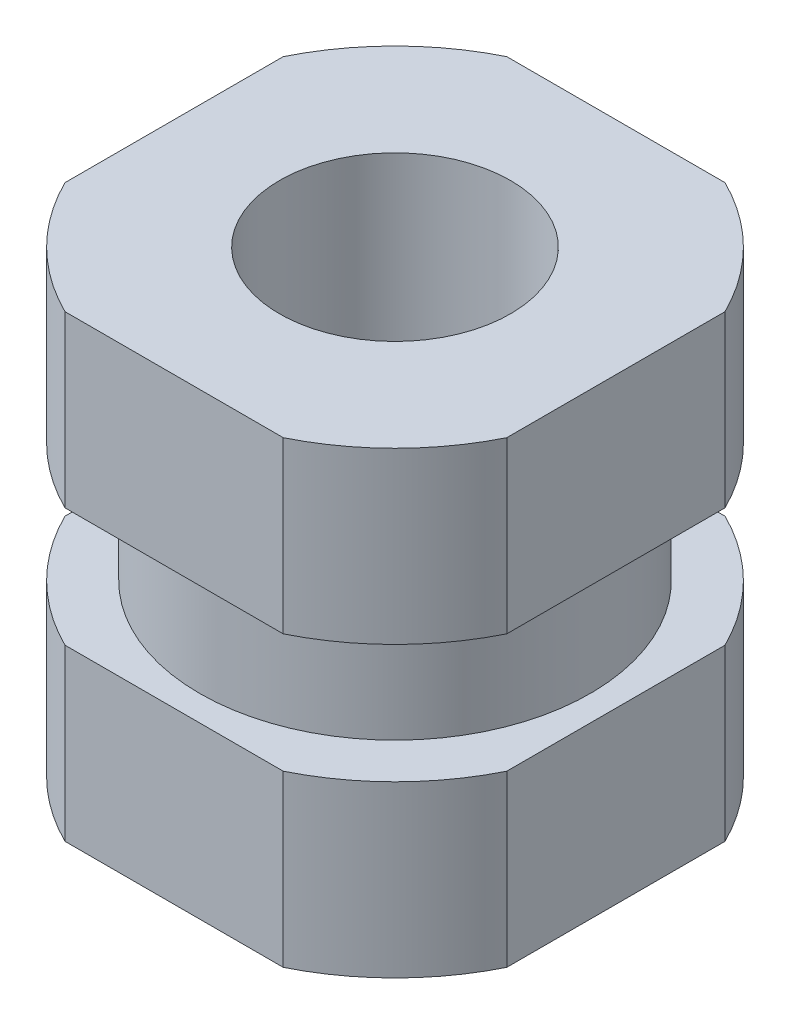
ISO-10303-21;
HEADER;
FILE_DESCRIPTION(('STEP AP214'),'2;1');
FILE_NAME('part.step','',(''),(''),'','','');
FILE_SCHEMA(('AUTOMOTIVE_DESIGN { 1 0 10303 214 1 1 1 1 }'));
ENDSEC;
DATA;
#1=APPLICATION_CONTEXT('core data for automotive mechanical design processes');
#2=APPLICATION_PROTOCOL_DEFINITION('international standard','automotive_design',2000,#1);
#3=PRODUCT_CONTEXT('',#1,'mechanical');
#4=PRODUCT('Part','Part','',(#3));
#5=PRODUCT_RELATED_PRODUCT_CATEGORY('part','',(#4));
#6=PRODUCT_DEFINITION_FORMATION('','',#4);
#7=PRODUCT_DEFINITION_CONTEXT('part definition',#1,'design');
#8=PRODUCT_DEFINITION('design','',#6,#7);
#9=PRODUCT_DEFINITION_SHAPE('','',#8);
#10=(LENGTH_UNIT() NAMED_UNIT(*) SI_UNIT(.MILLI.,.METRE.));
#11=(NAMED_UNIT(*) PLANE_ANGLE_UNIT() SI_UNIT($,.RADIAN.));
#12=(NAMED_UNIT(*) SI_UNIT($,.STERADIAN.) SOLID_ANGLE_UNIT());
#13=UNCERTAINTY_MEASURE_WITH_UNIT(LENGTH_MEASURE(1.E-05),#10,'distance_accuracy_value','');
#14=(GEOMETRIC_REPRESENTATION_CONTEXT(3) GLOBAL_UNCERTAINTY_ASSIGNED_CONTEXT((#13)) GLOBAL_UNIT_ASSIGNED_CONTEXT((#10,
#11,#12)) REPRESENTATION_CONTEXT('',''));
#15=CARTESIAN_POINT('',(0.,0.,0.));
#16=DIRECTION('',(0.,0.,1.));
#17=DIRECTION('',(1.,0.,0.));
#18=AXIS2_PLACEMENT_3D('',#15,#16,#17);
#19=CARTESIAN_POINT('',(-15.0000004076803,-2.00000000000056,0.));
#20=DIRECTION('',(0.,1.,0.));
#21=DIRECTION('',(0.,0.,1.));
#22=AXIS2_PLACEMENT_3D('',#19,#20,#21);
#23=PLANE('',#22);
#24=CARTESIAN_POINT('',(-15.0000004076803,-2.00000000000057,0.));
#25=DIRECTION('',(0.,-1.,0.));
#26=DIRECTION('',(0.,0.,-1.));
#27=AXIS2_PLACEMENT_3D('',#24,#25,#26);
#28=CIRCLE('',#27,3.4);
#29=CARTESIAN_POINT('',(-15.0000004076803,-2.00000000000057,-3.4));
#30=VERTEX_POINT('',#29);
#31=EDGE_CURVE('E285',#30,#30,#28,.T.);
#32=ORIENTED_EDGE('',*,*,#31,.T.);
#33=EDGE_LOOP('',(#32));
#34=FACE_BOUND('',#33,.T.);
#35=CARTESIAN_POINT('',(-15.0000004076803,-2.00000000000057,0.));
#36=DIRECTION('',(0.,1.,0.));
#37=DIRECTION('',(0.,0.,1.));
#38=AXIS2_PLACEMENT_3D('',#35,#36,#37);
#39=CIRCLE('',#38,7.25);
#40=CARTESIAN_POINT('',(-18.2113085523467,-2.00000000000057,-6.5));
#41=VERTEX_POINT('',#40);
#42=CARTESIAN_POINT('',(-21.5000004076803,-2.00000000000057,-3.21130814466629));
#43=VERTEX_POINT('',#42);
#44=EDGE_CURVE('E220',#41,#43,#39,.T.);
#45=ORIENTED_EDGE('',*,*,#44,.T.);
#46=DIRECTION('',(0.,0.,1.));
#47=VECTOR('',#46,1.);
#48=CARTESIAN_POINT('',(-21.5000004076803,-2.00000000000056,0.));
#49=LINE('',#48,#47);
#50=CARTESIAN_POINT('',(-21.5000004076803,-2.00000000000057,3.21130814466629));
#51=VERTEX_POINT('',#50);
#52=EDGE_CURVE('E159',#43,#51,#49,.T.);
#53=ORIENTED_EDGE('',*,*,#52,.T.);
#54=CARTESIAN_POINT('',(-18.2113085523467,-2.00000000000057,6.5));
#55=VERTEX_POINT('',#54);
#56=EDGE_CURVE('E179',#51,#55,#39,.T.);
#57=ORIENTED_EDGE('',*,*,#56,.T.);
#58=DIRECTION('',(1.,0.,0.));
#59=VECTOR('',#58,1.);
#60=CARTESIAN_POINT('',(-15.0000004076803,-2.00000000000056,6.5));
#61=LINE('',#60,#59);
#62=CARTESIAN_POINT('',(-11.7886922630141,-2.00000000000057,6.5));
#63=VERTEX_POINT('',#62);
#64=EDGE_CURVE('E273',#55,#63,#61,.T.);
#65=ORIENTED_EDGE('',*,*,#64,.T.);
#66=CARTESIAN_POINT('',(-8.50000040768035,-2.00000000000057,3.21130814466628));
#67=VERTEX_POINT('',#66);
#68=EDGE_CURVE('E139',#63,#67,#39,.T.);
#69=ORIENTED_EDGE('',*,*,#68,.T.);
#70=DIRECTION('',(0.,0.,-1.));
#71=VECTOR('',#70,1.);
#72=CARTESIAN_POINT('',(-8.50000040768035,-2.00000000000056,0.));
#73=LINE('',#72,#71);
#74=CARTESIAN_POINT('',(-8.50000040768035,-2.00000000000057,-3.21130814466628));
#75=VERTEX_POINT('',#74);
#76=EDGE_CURVE('E226',#67,#75,#73,.T.);
#77=ORIENTED_EDGE('',*,*,#76,.T.);
#78=CARTESIAN_POINT('',(-11.7886922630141,-2.00000000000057,-6.5));
#79=VERTEX_POINT('',#78);
#80=EDGE_CURVE('E182',#75,#79,#39,.T.);
#81=ORIENTED_EDGE('',*,*,#80,.T.);
#82=DIRECTION('',(-1.,0.,0.));
#83=VECTOR('',#82,1.);
#84=CARTESIAN_POINT('',(-15.0000004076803,-2.00000000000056,-6.5));
#85=LINE('',#84,#83);
#86=EDGE_CURVE('E225',#79,#41,#85,.T.);
#87=ORIENTED_EDGE('',*,*,#86,.T.);
#88=EDGE_LOOP('',(#45,#53,#57,#65,#69,#77,#81,#87));
#89=FACE_BOUND('',#88,.T.);
#90=ADVANCED_FACE('F16',(#34,#89),#23,.T.);
#91=CARTESIAN_POINT('',(-15.0000004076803,-2.00000000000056,0.));
#92=DIRECTION('',(0.,1.,0.));
#93=DIRECTION('',(0.,0.,1.));
#94=AXIS2_PLACEMENT_3D('',#91,#92,#93);
#95=CYLINDRICAL_SURFACE('',#94,7.25);
#96=ORIENTED_EDGE('',*,*,#56,.F.);
#97=DIRECTION('',(0.,1.,0.));
#98=VECTOR('',#97,1.);
#99=CARTESIAN_POINT('',(-21.5000004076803,-2.00000000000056,3.21130814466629));
#100=LINE('',#99,#98);
#101=CARTESIAN_POINT('',(-21.5000004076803,-7.00000000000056,3.21130814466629));
#102=VERTEX_POINT('',#101);
#103=EDGE_CURVE('E207',#51,#102,#100,.F.);
#104=ORIENTED_EDGE('',*,*,#103,.T.);
#105=CARTESIAN_POINT('',(-15.0000004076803,-7.00000000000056,0.));
#106=DIRECTION('',(0.,1.,0.));
#107=DIRECTION('',(0.,0.,1.));
#108=AXIS2_PLACEMENT_3D('',#105,#106,#107);
#109=CIRCLE('',#108,7.25);
#110=CARTESIAN_POINT('',(-18.2113085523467,-7.00000000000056,6.5));
#111=VERTEX_POINT('',#110);
#112=EDGE_CURVE('E175',#102,#111,#109,.T.);
#113=ORIENTED_EDGE('',*,*,#112,.T.);
#114=DIRECTION('',(0.,1.,0.));
#115=VECTOR('',#114,1.);
#116=CARTESIAN_POINT('',(-18.2113085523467,-2.00000000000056,6.5));
#117=LINE('',#116,#115);
#118=EDGE_CURVE('E30',#111,#55,#117,.T.);
#119=ORIENTED_EDGE('',*,*,#118,.T.);
#120=EDGE_LOOP('',(#96,#104,#113,#119));
#121=FACE_BOUND('',#120,.T.);
#122=ADVANCED_FACE('F221',(#121),#95,.T.);
#123=CARTESIAN_POINT('',(-18.2113085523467,-7.00000000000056,-6.5));
#124=VERTEX_POINT('',#123);
#125=CARTESIAN_POINT('',(-21.5000004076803,-7.00000000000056,-3.21130814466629));
#126=VERTEX_POINT('',#125);
#127=EDGE_CURVE('E357',#124,#126,#109,.T.);
#128=ORIENTED_EDGE('',*,*,#127,.T.);
#129=DIRECTION('',(0.,1.,0.));
#130=VECTOR('',#129,1.);
#131=CARTESIAN_POINT('',(-21.5000004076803,-2.00000000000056,-3.21130814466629));
#132=LINE('',#131,#130);
#133=EDGE_CURVE('E38',#126,#43,#132,.T.);
#134=ORIENTED_EDGE('',*,*,#133,.T.);
#135=ORIENTED_EDGE('',*,*,#44,.F.);
#136=DIRECTION('',(0.,1.,0.));
#137=VECTOR('',#136,1.);
#138=CARTESIAN_POINT('',(-18.2113085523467,-2.00000000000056,-6.5));
#139=LINE('',#138,#137);
#140=EDGE_CURVE('E237',#41,#124,#139,.F.);
#141=ORIENTED_EDGE('',*,*,#140,.T.);
#142=EDGE_LOOP('',(#128,#134,#135,#141));
#143=FACE_BOUND('',#142,.T.);
#144=ADVANCED_FACE('F316',(#143),#95,.T.);
#145=ORIENTED_EDGE('',*,*,#68,.F.);
#146=DIRECTION('',(0.,1.,0.));
#147=VECTOR('',#146,1.);
#148=CARTESIAN_POINT('',(-11.7886922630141,-2.00000000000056,6.5));
#149=LINE('',#148,#147);
#150=CARTESIAN_POINT('',(-11.7886922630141,-7.00000000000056,6.5));
#151=VERTEX_POINT('',#150);
#152=EDGE_CURVE('E270',#63,#151,#149,.F.);
#153=ORIENTED_EDGE('',*,*,#152,.T.);
#154=CARTESIAN_POINT('',(-8.50000040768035,-7.00000000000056,3.21130814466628));
#155=VERTEX_POINT('',#154);
#156=EDGE_CURVE('E176',#151,#155,#109,.T.);
#157=ORIENTED_EDGE('',*,*,#156,.T.);
#158=DIRECTION('',(0.,1.,0.));
#159=VECTOR('',#158,1.);
#160=CARTESIAN_POINT('',(-8.50000040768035,-2.00000000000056,3.21130814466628));
#161=LINE('',#160,#159);
#162=EDGE_CURVE('E256',#155,#67,#161,.T.);
#163=ORIENTED_EDGE('',*,*,#162,.T.);
#164=EDGE_LOOP('',(#145,#153,#157,#163));
#165=FACE_BOUND('',#164,.T.);
#166=ADVANCED_FACE('F356',(#165),#95,.T.);
#167=ORIENTED_EDGE('',*,*,#80,.F.);
#168=DIRECTION('',(0.,1.,0.));
#169=VECTOR('',#168,1.);
#170=CARTESIAN_POINT('',(-8.50000040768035,-2.00000000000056,-3.21130814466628));
#171=LINE('',#170,#169);
#172=CARTESIAN_POINT('',(-8.50000040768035,-7.00000000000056,-3.21130814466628));
#173=VERTEX_POINT('',#172);
#174=EDGE_CURVE('E232',#75,#173,#171,.F.);
#175=ORIENTED_EDGE('',*,*,#174,.T.);
#176=CARTESIAN_POINT('',(-11.7886922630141,-7.00000000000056,-6.5));
#177=VERTEX_POINT('',#176);
#178=EDGE_CURVE('E180',#173,#177,#109,.T.);
#179=ORIENTED_EDGE('',*,*,#178,.T.);
#180=DIRECTION('',(0.,1.,0.));
#181=VECTOR('',#180,1.);
#182=CARTESIAN_POINT('',(-11.7886922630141,-2.00000000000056,-6.5));
#183=LINE('',#182,#181);
#184=EDGE_CURVE('E234',#177,#79,#183,.T.);
#185=ORIENTED_EDGE('',*,*,#184,.T.);
#186=EDGE_LOOP('',(#167,#175,#179,#185));
#187=FACE_BOUND('',#186,.T.);
#188=ADVANCED_FACE('F230',(#187),#95,.T.);
#189=CARTESIAN_POINT('',(-22.2500004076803,-7.00000000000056,0.));
#190=DIRECTION('',(0.,-1.,0.));
#191=DIRECTION('',(0.,0.,-1.));
#192=AXIS2_PLACEMENT_3D('',#189,#190,#191);
#193=PLANE('',#192);
#194=CARTESIAN_POINT('',(-15.0000004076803,-7.00000000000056,0.));
#195=DIRECTION('',(0.,1.,0.));
#196=DIRECTION('',(0.,0.,1.));
#197=AXIS2_PLACEMENT_3D('',#194,#195,#196);
#198=CIRCLE('',#197,5.75);
#199=CARTESIAN_POINT('',(-15.0000004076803,-7.00000000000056,5.75));
#200=VERTEX_POINT('',#199);
#201=EDGE_CURVE('E172',#200,#200,#198,.T.);
#202=ORIENTED_EDGE('',*,*,#201,.T.);
#203=EDGE_LOOP('',(#202));
#204=FACE_BOUND('',#203,.T.);
#205=ORIENTED_EDGE('',*,*,#112,.F.);
#206=DIRECTION('',(0.,0.,-1.));
#207=VECTOR('',#206,1.);
#208=CARTESIAN_POINT('',(-21.5000004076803,-7.00000000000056,0.));
#209=LINE('',#208,#207);
#210=EDGE_CURVE('E199',#102,#126,#209,.T.);
#211=ORIENTED_EDGE('',*,*,#210,.T.);
#212=ORIENTED_EDGE('',*,*,#127,.F.);
#213=DIRECTION('',(1.,0.,0.));
#214=VECTOR('',#213,1.);
#215=CARTESIAN_POINT('',(-22.2500004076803,-7.00000000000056,-6.5));
#216=LINE('',#215,#214);
#217=EDGE_CURVE('E149',#124,#177,#216,.T.);
#218=ORIENTED_EDGE('',*,*,#217,.T.);
#219=ORIENTED_EDGE('',*,*,#178,.F.);
#220=DIRECTION('',(0.,0.,1.));
#221=VECTOR('',#220,1.);
#222=CARTESIAN_POINT('',(-8.50000040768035,-7.00000000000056,0.));
#223=LINE('',#222,#221);
#224=EDGE_CURVE('E253',#173,#155,#223,.T.);
#225=ORIENTED_EDGE('',*,*,#224,.T.);
#226=ORIENTED_EDGE('',*,*,#156,.F.);
#227=DIRECTION('',(-1.,0.,0.));
#228=VECTOR('',#227,1.);
#229=CARTESIAN_POINT('',(-22.2500004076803,-7.00000000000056,6.5));
#230=LINE('',#229,#228);
#231=EDGE_CURVE('E267',#151,#111,#230,.T.);
#232=ORIENTED_EDGE('',*,*,#231,.T.);
#233=EDGE_LOOP('',(#205,#211,#212,#218,#219,#225,#226,#232));
#234=FACE_BOUND('',#233,.T.);
#235=ADVANCED_FACE('F355',(#204,#234),#193,.T.);
#236=CARTESIAN_POINT('',(-22.2500004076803,-10.5000000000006,0.));
#237=DIRECTION('',(0.,1.,0.));
#238=DIRECTION('',(0.,0.,1.));
#239=AXIS2_PLACEMENT_3D('',#236,#237,#238);
#240=PLANE('',#239);
#241=CARTESIAN_POINT('',(-15.0000004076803,-10.5000000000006,0.));
#242=DIRECTION('',(0.,1.,0.));
#243=DIRECTION('',(0.,0.,1.));
#244=AXIS2_PLACEMENT_3D('',#241,#242,#243);
#245=CIRCLE('',#244,5.75);
#246=CARTESIAN_POINT('',(-15.0000004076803,-10.5000000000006,5.75));
#247=VERTEX_POINT('',#246);
#248=EDGE_CURVE('E168',#247,#247,#245,.T.);
#249=ORIENTED_EDGE('',*,*,#248,.F.);
#250=EDGE_LOOP('',(#249));
#251=FACE_BOUND('',#250,.T.);
#252=CARTESIAN_POINT('',(-15.0000004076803,-10.5000000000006,0.));
#253=DIRECTION('',(0.,1.,0.));
#254=DIRECTION('',(0.,0.,1.));
#255=AXIS2_PLACEMENT_3D('',#252,#253,#254);
#256=CIRCLE('',#255,7.25);
#257=CARTESIAN_POINT('',(-18.2113085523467,-10.5000000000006,-6.5));
#258=VERTEX_POINT('',#257);
#259=CARTESIAN_POINT('',(-21.5000004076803,-10.5000000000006,-3.21130814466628));
#260=VERTEX_POINT('',#259);
#261=EDGE_CURVE('E148',#258,#260,#256,.T.);
#262=ORIENTED_EDGE('',*,*,#261,.T.);
#263=DIRECTION('',(0.,0.,1.));
#264=VECTOR('',#263,1.);
#265=CARTESIAN_POINT('',(-21.5000004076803,-10.5000000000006,0.));
#266=LINE('',#265,#264);
#267=CARTESIAN_POINT('',(-21.5000004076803,-10.5000000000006,3.21130814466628));
#268=VERTEX_POINT('',#267);
#269=EDGE_CURVE('E200',#260,#268,#266,.T.);
#270=ORIENTED_EDGE('',*,*,#269,.T.);
#271=CARTESIAN_POINT('',(-18.2113085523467,-10.5000000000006,6.5));
#272=VERTEX_POINT('',#271);
#273=EDGE_CURVE('E163',#268,#272,#256,.T.);
#274=ORIENTED_EDGE('',*,*,#273,.T.);
#275=DIRECTION('',(1.,0.,0.));
#276=VECTOR('',#275,1.);
#277=CARTESIAN_POINT('',(-22.2500004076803,-10.5000000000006,6.5));
#278=LINE('',#277,#276);
#279=CARTESIAN_POINT('',(-11.7886922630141,-10.5000000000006,6.5));
#280=VERTEX_POINT('',#279);
#281=EDGE_CURVE('E262',#272,#280,#278,.T.);
#282=ORIENTED_EDGE('',*,*,#281,.T.);
#283=CARTESIAN_POINT('',(-8.50000040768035,-10.5000000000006,3.21130814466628));
#284=VERTEX_POINT('',#283);
#285=EDGE_CURVE('E165',#280,#284,#256,.T.);
#286=ORIENTED_EDGE('',*,*,#285,.T.);
#287=DIRECTION('',(0.,0.,-1.));
#288=VECTOR('',#287,1.);
#289=CARTESIAN_POINT('',(-8.50000040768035,-10.5000000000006,0.));
#290=LINE('',#289,#288);
#291=CARTESIAN_POINT('',(-8.50000040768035,-10.5000000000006,-3.21130814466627));
#292=VERTEX_POINT('',#291);
#293=EDGE_CURVE('E247',#284,#292,#290,.T.);
#294=ORIENTED_EDGE('',*,*,#293,.T.);
#295=CARTESIAN_POINT('',(-11.7886922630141,-10.5000000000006,-6.5));
#296=VERTEX_POINT('',#295);
#297=EDGE_CURVE('E169',#292,#296,#256,.T.);
#298=ORIENTED_EDGE('',*,*,#297,.T.);
#299=DIRECTION('',(-1.,0.,0.));
#300=VECTOR('',#299,1.);
#301=CARTESIAN_POINT('',(-22.2500004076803,-10.5000000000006,-6.5));
#302=LINE('',#301,#300);
#303=EDGE_CURVE('E150',#296,#258,#302,.T.);
#304=ORIENTED_EDGE('',*,*,#303,.T.);
#305=EDGE_LOOP('',(#262,#270,#274,#282,#286,#294,#298,#304));
#306=FACE_BOUND('',#305,.T.);
#307=ADVANCED_FACE('F275',(#251,#306),#240,.T.);
#308=CARTESIAN_POINT('',(-15.0000004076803,-2.00000000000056,0.));
#309=DIRECTION('',(0.,1.,0.));
#310=DIRECTION('',(0.,0.,1.));
#311=AXIS2_PLACEMENT_3D('',#308,#309,#310);
#312=CYLINDRICAL_SURFACE('',#311,7.25);
#313=ORIENTED_EDGE('',*,*,#273,.F.);
#314=DIRECTION('',(0.,1.,0.));
#315=VECTOR('',#314,1.);
#316=CARTESIAN_POINT('',(-21.5000004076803,-2.00000000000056,3.21130814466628));
#317=LINE('',#316,#315);
#318=CARTESIAN_POINT('',(-21.5000004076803,-15.5000000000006,3.21130814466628));
#319=VERTEX_POINT('',#318);
#320=EDGE_CURVE('E196',#268,#319,#317,.F.);
#321=ORIENTED_EDGE('',*,*,#320,.T.);
#322=CARTESIAN_POINT('',(-15.0000004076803,-15.5000000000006,0.));
#323=DIRECTION('',(0.,1.,0.));
#324=DIRECTION('',(0.,0.,1.));
#325=AXIS2_PLACEMENT_3D('',#322,#323,#324);
#326=CIRCLE('',#325,7.25);
#327=CARTESIAN_POINT('',(-18.2113085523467,-15.5000000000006,6.5));
#328=VERTEX_POINT('',#327);
#329=EDGE_CURVE('E155',#319,#328,#326,.T.);
#330=ORIENTED_EDGE('',*,*,#329,.T.);
#331=DIRECTION('',(0.,1.,0.));
#332=VECTOR('',#331,1.);
#333=CARTESIAN_POINT('',(-18.2113085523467,-2.00000000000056,6.5));
#334=LINE('',#333,#332);
#335=EDGE_CURVE('E194',#328,#272,#334,.T.);
#336=ORIENTED_EDGE('',*,*,#335,.T.);
#337=EDGE_LOOP('',(#313,#321,#330,#336));
#338=FACE_BOUND('',#337,.T.);
#339=ADVANCED_FACE('F193',(#338),#312,.T.);
#340=CARTESIAN_POINT('',(-18.2113085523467,-15.5000000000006,-6.5));
#341=VERTEX_POINT('',#340);
#342=CARTESIAN_POINT('',(-21.5000004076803,-15.5000000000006,-3.21130814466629));
#343=VERTEX_POINT('',#342);
#344=EDGE_CURVE('E146',#341,#343,#326,.T.);
#345=ORIENTED_EDGE('',*,*,#344,.T.);
#346=DIRECTION('',(0.,1.,0.));
#347=VECTOR('',#346,1.);
#348=CARTESIAN_POINT('',(-21.5000004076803,-2.00000000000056,-3.21130814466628));
#349=LINE('',#348,#347);
#350=EDGE_CURVE('E203',#343,#260,#349,.T.);
#351=ORIENTED_EDGE('',*,*,#350,.T.);
#352=ORIENTED_EDGE('',*,*,#261,.F.);
#353=DIRECTION('',(0.,1.,0.));
#354=VECTOR('',#353,1.);
#355=CARTESIAN_POINT('',(-18.2113085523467,-2.00000000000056,-6.5));
#356=LINE('',#355,#354);
#357=EDGE_CURVE('E130',#258,#341,#356,.F.);
#358=ORIENTED_EDGE('',*,*,#357,.T.);
#359=EDGE_LOOP('',(#345,#351,#352,#358));
#360=FACE_BOUND('',#359,.T.);
#361=ADVANCED_FACE('F144',(#360),#312,.T.);
#362=ORIENTED_EDGE('',*,*,#285,.F.);
#363=DIRECTION('',(0.,1.,0.));
#364=VECTOR('',#363,1.);
#365=CARTESIAN_POINT('',(-11.7886922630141,-2.00000000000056,6.5));
#366=LINE('',#365,#364);
#367=CARTESIAN_POINT('',(-11.7886922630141,-15.5000000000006,6.5));
#368=VERTEX_POINT('',#367);
#369=EDGE_CURVE('E265',#280,#368,#366,.F.);
#370=ORIENTED_EDGE('',*,*,#369,.T.);
#371=CARTESIAN_POINT('',(-8.50000040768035,-15.5000000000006,3.21130814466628));
#372=VERTEX_POINT('',#371);
#373=EDGE_CURVE('E157',#368,#372,#326,.T.);
#374=ORIENTED_EDGE('',*,*,#373,.T.);
#375=DIRECTION('',(0.,1.,0.));
#376=VECTOR('',#375,1.);
#377=CARTESIAN_POINT('',(-8.50000040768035,-2.00000000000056,3.21130814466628));
#378=LINE('',#377,#376);
#379=EDGE_CURVE('E244',#372,#284,#378,.T.);
#380=ORIENTED_EDGE('',*,*,#379,.T.);
#381=EDGE_LOOP('',(#362,#370,#374,#380));
#382=FACE_BOUND('',#381,.T.);
#383=ADVANCED_FACE('F279',(#382),#312,.T.);
#384=ORIENTED_EDGE('',*,*,#297,.F.);
#385=DIRECTION('',(0.,1.,0.));
#386=VECTOR('',#385,1.);
#387=CARTESIAN_POINT('',(-8.50000040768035,-2.00000000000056,-3.21130814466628));
#388=LINE('',#387,#386);
#389=CARTESIAN_POINT('',(-8.50000040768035,-15.5000000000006,-3.21130814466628));
#390=VERTEX_POINT('',#389);
#391=EDGE_CURVE('E250',#292,#390,#388,.F.);
#392=ORIENTED_EDGE('',*,*,#391,.T.);
#393=CARTESIAN_POINT('',(-11.7886922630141,-15.5000000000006,-6.5));
#394=VERTEX_POINT('',#393);
#395=EDGE_CURVE('E154',#390,#394,#326,.T.);
#396=ORIENTED_EDGE('',*,*,#395,.T.);
#397=DIRECTION('',(0.,1.,0.));
#398=VECTOR('',#397,1.);
#399=CARTESIAN_POINT('',(-11.7886922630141,-2.00000000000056,-6.5));
#400=LINE('',#399,#398);
#401=EDGE_CURVE('E133',#394,#296,#400,.T.);
#402=ORIENTED_EDGE('',*,*,#401,.T.);
#403=EDGE_LOOP('',(#384,#392,#396,#402));
#404=FACE_BOUND('',#403,.T.);
#405=ADVANCED_FACE('F284',(#404),#312,.T.);
#406=CARTESIAN_POINT('',(-22.2500004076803,-15.5000000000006,0.));
#407=DIRECTION('',(0.,-1.,0.));
#408=DIRECTION('',(0.,0.,-1.));
#409=AXIS2_PLACEMENT_3D('',#406,#407,#408);
#410=PLANE('',#409);
#411=CARTESIAN_POINT('',(-15.0000004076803,-15.5000000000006,0.));
#412=DIRECTION('',(0.,-1.,0.));
#413=DIRECTION('',(0.,0.,-1.));
#414=AXIS2_PLACEMENT_3D('',#411,#412,#413);
#415=CIRCLE('',#414,3.4);
#416=CARTESIAN_POINT('',(-15.0000004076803,-15.5000000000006,-3.4));
#417=VERTEX_POINT('',#416);
#418=EDGE_CURVE('E289',#417,#417,#415,.T.);
#419=ORIENTED_EDGE('',*,*,#418,.F.);
#420=EDGE_LOOP('',(#419));
#421=FACE_BOUND('',#420,.T.);
#422=ORIENTED_EDGE('',*,*,#329,.F.);
#423=DIRECTION('',(0.,0.,-1.));
#424=VECTOR('',#423,1.);
#425=CARTESIAN_POINT('',(-21.5000004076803,-15.5000000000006,0.));
#426=LINE('',#425,#424);
#427=EDGE_CURVE('E11',#319,#343,#426,.T.);
#428=ORIENTED_EDGE('',*,*,#427,.T.);
#429=ORIENTED_EDGE('',*,*,#344,.F.);
#430=DIRECTION('',(1.,0.,0.));
#431=VECTOR('',#430,1.);
#432=CARTESIAN_POINT('',(-22.2500004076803,-15.5000000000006,-6.5));
#433=LINE('',#432,#431);
#434=EDGE_CURVE('E127',#341,#394,#433,.T.);
#435=ORIENTED_EDGE('',*,*,#434,.T.);
#436=ORIENTED_EDGE('',*,*,#395,.F.);
#437=DIRECTION('',(0.,0.,1.));
#438=VECTOR('',#437,1.);
#439=CARTESIAN_POINT('',(-8.50000040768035,-15.5000000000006,0.));
#440=LINE('',#439,#438);
#441=EDGE_CURVE('E138',#390,#372,#440,.T.);
#442=ORIENTED_EDGE('',*,*,#441,.T.);
#443=ORIENTED_EDGE('',*,*,#373,.F.);
#444=DIRECTION('',(-1.,0.,0.));
#445=VECTOR('',#444,1.);
#446=CARTESIAN_POINT('',(-22.2500004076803,-15.5000000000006,6.5));
#447=LINE('',#446,#445);
#448=EDGE_CURVE('E23',#368,#328,#447,.T.);
#449=ORIENTED_EDGE('',*,*,#448,.T.);
#450=EDGE_LOOP('',(#422,#428,#429,#435,#436,#442,#443,#449));
#451=FACE_BOUND('',#450,.T.);
#452=ADVANCED_FACE('F153',(#421,#451),#410,.T.);
#453=CARTESIAN_POINT('',(-15.0000004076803,-2.00000000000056,0.));
#454=DIRECTION('',(0.,1.,0.));
#455=DIRECTION('',(0.,0.,1.));
#456=AXIS2_PLACEMENT_3D('',#453,#454,#455);
#457=CYLINDRICAL_SURFACE('',#456,5.75);
#458=ORIENTED_EDGE('',*,*,#248,.T.);
#459=EDGE_LOOP('',(#458));
#460=FACE_BOUND('',#459,.T.);
#461=ORIENTED_EDGE('',*,*,#201,.F.);
#462=EDGE_LOOP('',(#461));
#463=FACE_BOUND('',#462,.T.);
#464=ADVANCED_FACE('F298',(#460,#463),#457,.T.);
#465=CARTESIAN_POINT('',(-8.50000040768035,-0.500000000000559,-6.5));
#466=DIRECTION('',(0.,0.,-1.));
#467=DIRECTION('',(-1.,0.,0.));
#468=AXIS2_PLACEMENT_3D('',#465,#466,#467);
#469=PLANE('',#468);
#470=ORIENTED_EDGE('',*,*,#303,.F.);
#471=ORIENTED_EDGE('',*,*,#401,.F.);
#472=ORIENTED_EDGE('',*,*,#434,.F.);
#473=ORIENTED_EDGE('',*,*,#357,.F.);
#474=EDGE_LOOP('',(#470,#471,#472,#473));
#475=FACE_BOUND('',#474,.T.);
#476=ADVANCED_FACE('F129',(#475),#469,.T.);
#477=CARTESIAN_POINT('',(-8.50000040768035,-0.500000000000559,-6.5));
#478=DIRECTION('',(1.,0.,0.));
#479=DIRECTION('',(0.,0.,-1.));
#480=AXIS2_PLACEMENT_3D('',#477,#478,#479);
#481=PLANE('',#480);
#482=ORIENTED_EDGE('',*,*,#293,.F.);
#483=ORIENTED_EDGE('',*,*,#379,.F.);
#484=ORIENTED_EDGE('',*,*,#441,.F.);
#485=ORIENTED_EDGE('',*,*,#391,.F.);
#486=EDGE_LOOP('',(#482,#483,#484,#485));
#487=FACE_BOUND('',#486,.T.);
#488=ADVANCED_FACE('F281',(#487),#481,.T.);
#489=CARTESIAN_POINT('',(-8.50000040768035,-0.500000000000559,6.5));
#490=DIRECTION('',(0.,0.,1.));
#491=DIRECTION('',(1.,0.,0.));
#492=AXIS2_PLACEMENT_3D('',#489,#490,#491);
#493=PLANE('',#492);
#494=ORIENTED_EDGE('',*,*,#281,.F.);
#495=ORIENTED_EDGE('',*,*,#335,.F.);
#496=ORIENTED_EDGE('',*,*,#448,.F.);
#497=ORIENTED_EDGE('',*,*,#369,.F.);
#498=EDGE_LOOP('',(#494,#495,#496,#497));
#499=FACE_BOUND('',#498,.T.);
#500=ADVANCED_FACE('F329',(#499),#493,.T.);
#501=CARTESIAN_POINT('',(-21.5000004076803,-0.500000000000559,-6.5));
#502=DIRECTION('',(-1.,0.,0.));
#503=DIRECTION('',(0.,0.,1.));
#504=AXIS2_PLACEMENT_3D('',#501,#502,#503);
#505=PLANE('',#504);
#506=ORIENTED_EDGE('',*,*,#269,.F.);
#507=ORIENTED_EDGE('',*,*,#350,.F.);
#508=ORIENTED_EDGE('',*,*,#427,.F.);
#509=ORIENTED_EDGE('',*,*,#320,.F.);
#510=EDGE_LOOP('',(#506,#507,#508,#509));
#511=FACE_BOUND('',#510,.T.);
#512=ADVANCED_FACE('F327',(#511),#505,.T.);
#513=ORIENTED_EDGE('',*,*,#184,.F.);
#514=ORIENTED_EDGE('',*,*,#217,.F.);
#515=ORIENTED_EDGE('',*,*,#140,.F.);
#516=ORIENTED_EDGE('',*,*,#86,.F.);
#517=EDGE_LOOP('',(#513,#514,#515,#516));
#518=FACE_BOUND('',#517,.T.);
#519=ADVANCED_FACE('F336',(#518),#469,.T.);
#520=ORIENTED_EDGE('',*,*,#162,.F.);
#521=ORIENTED_EDGE('',*,*,#224,.F.);
#522=ORIENTED_EDGE('',*,*,#174,.F.);
#523=ORIENTED_EDGE('',*,*,#76,.F.);
#524=EDGE_LOOP('',(#520,#521,#522,#523));
#525=FACE_BOUND('',#524,.T.);
#526=ADVANCED_FACE('F334',(#525),#481,.T.);
#527=ORIENTED_EDGE('',*,*,#118,.F.);
#528=ORIENTED_EDGE('',*,*,#231,.F.);
#529=ORIENTED_EDGE('',*,*,#152,.F.);
#530=ORIENTED_EDGE('',*,*,#64,.F.);
#531=EDGE_LOOP('',(#527,#528,#529,#530));
#532=FACE_BOUND('',#531,.T.);
#533=ADVANCED_FACE('F326',(#532),#493,.T.);
#534=ORIENTED_EDGE('',*,*,#133,.F.);
#535=ORIENTED_EDGE('',*,*,#210,.F.);
#536=ORIENTED_EDGE('',*,*,#103,.F.);
#537=ORIENTED_EDGE('',*,*,#52,.F.);
#538=EDGE_LOOP('',(#534,#535,#536,#537));
#539=FACE_BOUND('',#538,.T.);
#540=ADVANCED_FACE('F320',(#539),#505,.T.);
#541=CARTESIAN_POINT('',(-15.0000004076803,-15.5000000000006,0.));
#542=DIRECTION('',(0.,-1.,0.));
#543=DIRECTION('',(0.,0.,-1.));
#544=AXIS2_PLACEMENT_3D('',#541,#542,#543);
#545=CYLINDRICAL_SURFACE('',#544,3.4);
#546=ORIENTED_EDGE('',*,*,#31,.F.);
#547=EDGE_LOOP('',(#546));
#548=FACE_BOUND('',#547,.T.);
#549=ORIENTED_EDGE('',*,*,#418,.T.);
#550=EDGE_LOOP('',(#549));
#551=FACE_BOUND('',#550,.T.);
#552=ADVANCED_FACE('F295',(#548,#551),#545,.F.);
#553=CLOSED_SHELL('',(#90,#122,#144,#166,#188,#235,#307,#339,#361,#383,#405,#452,#464,#476,#488,
#500,#512,#519,#526,#533,#540,#552));
#554=MANIFOLD_SOLID_BREP('B1',#553);
#555=ADVANCED_BREP_SHAPE_REPRESENTATION('',(#18,#554),#14);
#556=SHAPE_DEFINITION_REPRESENTATION(#9,#555);
ENDSEC;
END-ISO-10303-21;
